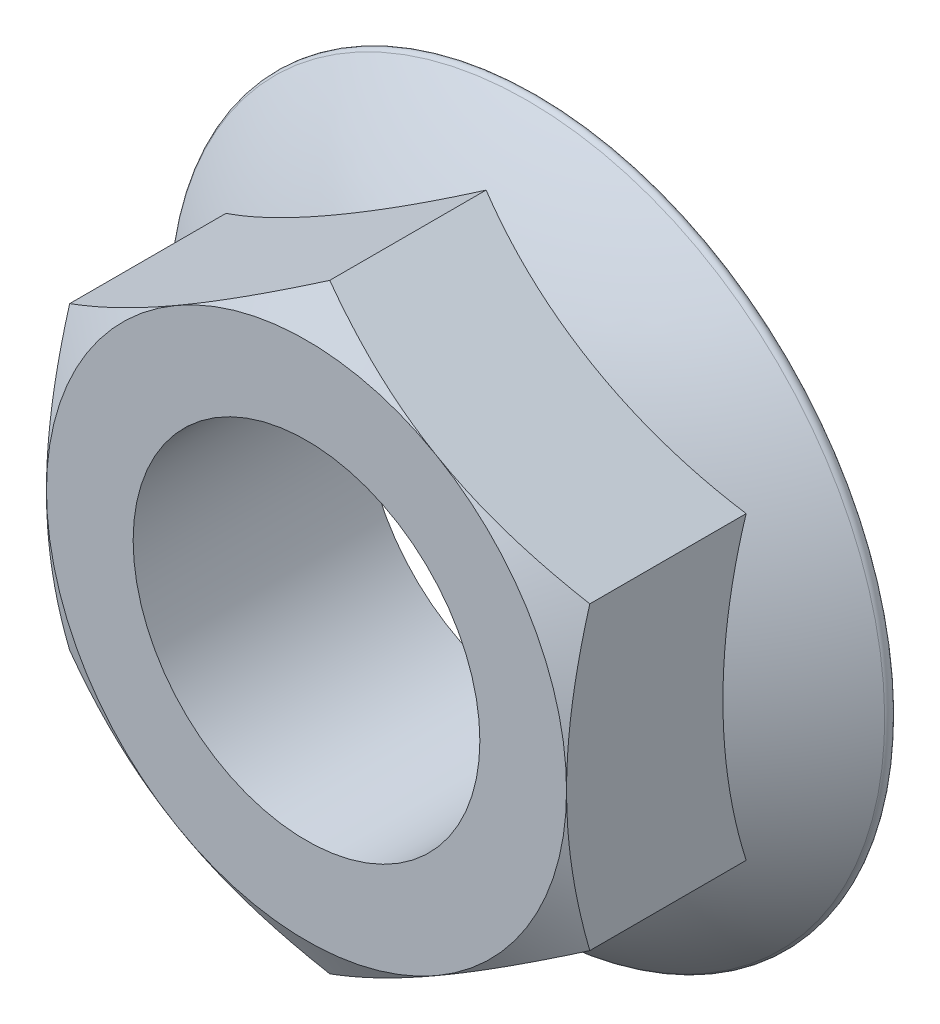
from build123d import *

# Parameters (mm, degrees)
BOSS_EXTRUDE1_DEPTH = 20
SKETCH3_OUTSIDE_W   = 151.498
SKETCH3_OUTSIDE_H   = 151.498
SKETCH3_OUTSIDE_R   = 22.5
CUT_EXTRUDE1_DEPTH  = 20
CUT_EXTRUDE1_DRAFT  = -60
SKETCH4_R           = 15
CUT_EXTRUDE2_DEPTH  = 49.302700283


with BuildPart() as part:
    # Sketch1 → Boss-Extrude1 (new body)
    with BuildSketch(Plane.XY):
        Polygon((0, 25.980762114), (-22.5, 12.990381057), (-22.5, -12.990381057), (0, -25.980762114), (22.5, -12.990381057), (22.5, 12.990381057), align=None)
    extrude(amount=BOSS_EXTRUDE1_DEPTH)

    # Sketch2 → Revolve1 (revolve)
    with BuildSketch(Plane(origin=(0, 0, 0), x_dir=(0, 0, -1), z_dir=(1, 0, 0)), mode=Mode.PRIVATE) as revolve1_sk:
        with BuildLine():
            Line((0, 0), (-12, 0))
            ThreePointArc((-12, 0), (-9.136925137, -16.422927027), (-0.885496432, -30.908217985))
            ThreePointArc((-0.885496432, -30.908217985), (-0.33080812, -31.060300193), (0, -30.589796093))
            Line((0, -30.589796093), (0, 0))
        make_face()
    revolve(revolve1_sk.sketch.rotate(Axis((0, 0, 0), (0, 0, 1)), 180), axis=Axis((0, 0, 0), (0, 0, 1)))


with BuildPart() as cut_extrude1_tool:
    # Sketch3 outside → Cut-Extrude1 (with draft: the straight prism first)
    with BuildSketch(Plane.XY.offset(20)):
        Rectangle(SKETCH3_OUTSIDE_W, SKETCH3_OUTSIDE_H)
        Circle(SKETCH3_OUTSIDE_R, mode=Mode.SUBTRACT)
    extrude(amount=-CUT_EXTRUDE1_DEPTH)
    # Cut-Extrude1: the draft: its side faces are tilted about the plane it starts from
    cut_extrude1_sides = [cut_extrude1_tool.faces().sort_by_distance(p)[0] for p in [
        (0, -75.749, 10),
        (75.749, 0, 10),
        (0, 75.749, 10),
        (-75.749, 0, 10),
        (-22.5, 0, 10),
    ]]
    draft(cut_extrude1_sides, Plane.XY.offset(20), CUT_EXTRUDE1_DRAFT)


with BuildPart() as part_1:
    add(part.part)

    # Cut-Extrude1: cut by cut_extrude1_tool
    add(cut_extrude1_tool.part, mode=Mode.SUBTRACT)

    # Sketch4 → Cut-Extrude2 (cut, through all)
    with BuildSketch(Plane.XY.offset(20)):
        Circle(SKETCH4_R)
    extrude(amount=-CUT_EXTRUDE2_DEPTH, mode=Mode.SUBTRACT)


solid = part_1.part
